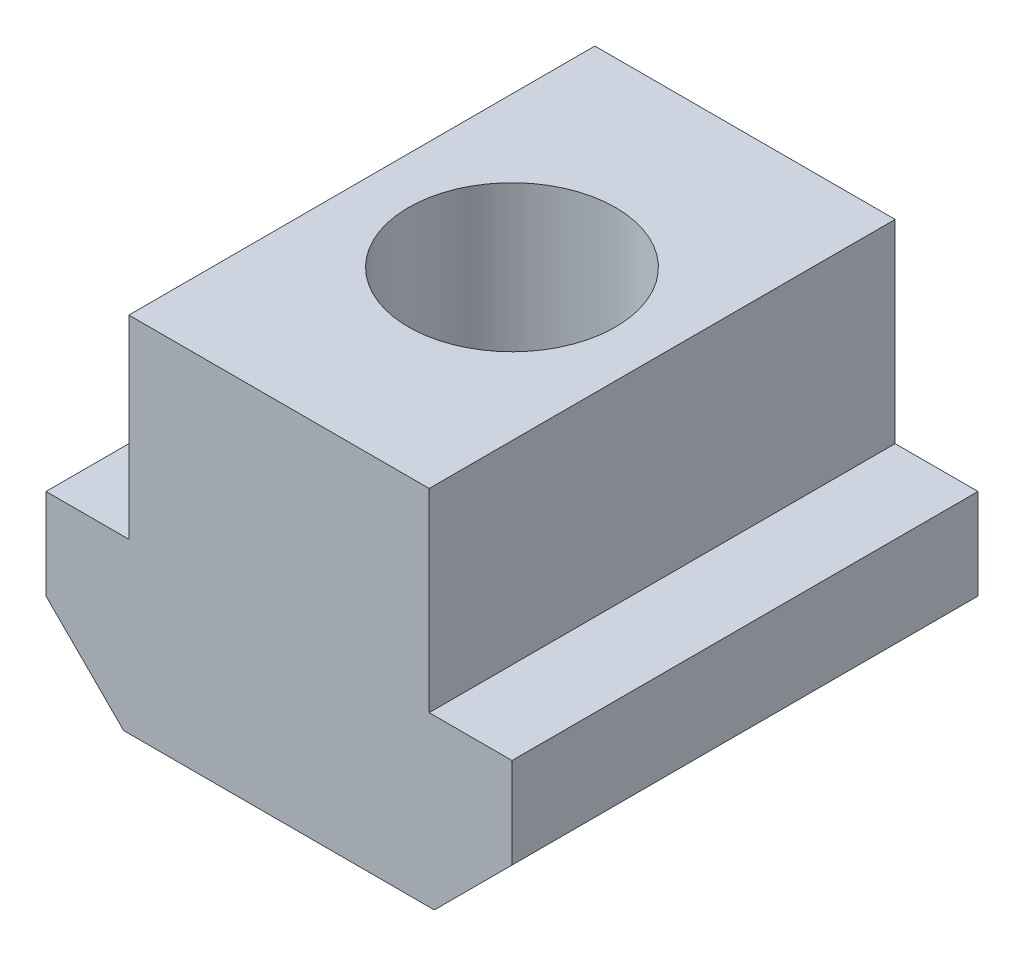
ISO-10303-21;
HEADER;
FILE_DESCRIPTION(('STEP AP214'),'2;1');
FILE_NAME('part.step','',(''),(''),'','','');
FILE_SCHEMA(('AUTOMOTIVE_DESIGN { 1 0 10303 214 1 1 1 1 }'));
ENDSEC;
DATA;
#1=APPLICATION_CONTEXT('core data for automotive mechanical design processes');
#2=APPLICATION_PROTOCOL_DEFINITION('international standard','automotive_design',2000,#1);
#3=PRODUCT_CONTEXT('',#1,'mechanical');
#4=PRODUCT('Part','Part','',(#3));
#5=PRODUCT_RELATED_PRODUCT_CATEGORY('part','',(#4));
#6=PRODUCT_DEFINITION_FORMATION('','',#4);
#7=PRODUCT_DEFINITION_CONTEXT('part definition',#1,'design');
#8=PRODUCT_DEFINITION('design','',#6,#7);
#9=PRODUCT_DEFINITION_SHAPE('','',#8);
#10=(LENGTH_UNIT() NAMED_UNIT(*) SI_UNIT(.MILLI.,.METRE.));
#11=(NAMED_UNIT(*) PLANE_ANGLE_UNIT() SI_UNIT($,.RADIAN.));
#12=(NAMED_UNIT(*) SI_UNIT($,.STERADIAN.) SOLID_ANGLE_UNIT());
#13=UNCERTAINTY_MEASURE_WITH_UNIT(LENGTH_MEASURE(1.E-05),#10,'distance_accuracy_value','');
#14=(GEOMETRIC_REPRESENTATION_CONTEXT(3) GLOBAL_UNCERTAINTY_ASSIGNED_CONTEXT((#13)) GLOBAL_UNIT_ASSIGNED_CONTEXT((#10,
#11,#12)) REPRESENTATION_CONTEXT('',''));
#15=CARTESIAN_POINT('',(0.,0.,0.));
#16=DIRECTION('',(0.,0.,1.));
#17=DIRECTION('',(1.,0.,0.));
#18=AXIS2_PLACEMENT_3D('',#15,#16,#17);
#19=CARTESIAN_POINT('',(-9.,7.,18.));
#20=DIRECTION('',(0.,-1.,0.));
#21=DIRECTION('',(0.,0.,-1.));
#22=AXIS2_PLACEMENT_3D('',#19,#20,#21);
#23=PLANE('',#22);
#24=CARTESIAN_POINT('',(0.,7.,9.));
#25=DIRECTION('',(0.,-1.,0.));
#26=DIRECTION('',(0.,0.,-1.));
#27=AXIS2_PLACEMENT_3D('',#24,#25,#26);
#28=CIRCLE('',#27,4.);
#29=CARTESIAN_POINT('',(0.,7.,5.));
#30=VERTEX_POINT('',#29);
#31=EDGE_CURVE('E195',#30,#30,#28,.T.);
#32=ORIENTED_EDGE('',*,*,#31,.T.);
#33=EDGE_LOOP('',(#32));
#34=FACE_BOUND('',#33,.T.);
#35=DIRECTION('',(0.,0.,-1.));
#36=VECTOR('',#35,1.);
#37=CARTESIAN_POINT('',(-5.8,7.,0.));
#38=LINE('',#37,#36);
#39=CARTESIAN_POINT('',(-5.8,7.,0.));
#40=VERTEX_POINT('',#39);
#41=CARTESIAN_POINT('',(-5.8,7.,18.));
#42=VERTEX_POINT('',#41);
#43=EDGE_CURVE('E164',#40,#42,#38,.F.);
#44=ORIENTED_EDGE('',*,*,#43,.T.);
#45=DIRECTION('',(-1.,0.,0.));
#46=VECTOR('',#45,1.);
#47=CARTESIAN_POINT('',(-9.,7.,18.));
#48=LINE('',#47,#46);
#49=CARTESIAN_POINT('',(5.8,7.,18.));
#50=VERTEX_POINT('',#49);
#51=EDGE_CURVE('E130',#50,#42,#48,.T.);
#52=ORIENTED_EDGE('',*,*,#51,.F.);
#53=DIRECTION('',(0.,0.,1.));
#54=VECTOR('',#53,1.);
#55=CARTESIAN_POINT('',(5.8,7.,0.));
#56=LINE('',#55,#54);
#57=CARTESIAN_POINT('',(5.8,7.,0.));
#58=VERTEX_POINT('',#57);
#59=EDGE_CURVE('E108',#50,#58,#56,.F.);
#60=ORIENTED_EDGE('',*,*,#59,.T.);
#61=DIRECTION('',(-1.,0.,0.));
#62=VECTOR('',#61,1.);
#63=CARTESIAN_POINT('',(-9.,7.,0.));
#64=LINE('',#63,#62);
#65=EDGE_CURVE('E150',#40,#58,#64,.F.);
#66=ORIENTED_EDGE('',*,*,#65,.F.);
#67=EDGE_LOOP('',(#44,#52,#60,#66));
#68=FACE_BOUND('',#67,.T.);
#69=ADVANCED_FACE('F17',(#34,#68),#23,.F.);
#70=CARTESIAN_POINT('',(-9.,-7.,18.));
#71=DIRECTION('',(0.,1.,0.));
#72=DIRECTION('',(0.,0.,1.));
#73=AXIS2_PLACEMENT_3D('',#70,#71,#72);
#74=PLANE('',#73);
#75=CARTESIAN_POINT('',(0.,-7.,9.));
#76=DIRECTION('',(0.,-1.,0.));
#77=DIRECTION('',(0.,0.,-1.));
#78=AXIS2_PLACEMENT_3D('',#75,#76,#77);
#79=CIRCLE('',#78,4.);
#80=CARTESIAN_POINT('',(0.,-7.,5.));
#81=VERTEX_POINT('',#80);
#82=EDGE_CURVE('E198',#81,#81,#79,.T.);
#83=ORIENTED_EDGE('',*,*,#82,.F.);
#84=EDGE_LOOP('',(#83));
#85=FACE_BOUND('',#84,.T.);
#86=DIRECTION('',(0.,0.,1.));
#87=VECTOR('',#86,1.);
#88=CARTESIAN_POINT('',(6.,-7.,18.));
#89=LINE('',#88,#87);
#90=CARTESIAN_POINT('',(6.,-7.,0.));
#91=VERTEX_POINT('',#90);
#92=CARTESIAN_POINT('',(6.,-7.,18.));
#93=VERTEX_POINT('',#92);
#94=EDGE_CURVE('E186',#91,#93,#89,.T.);
#95=ORIENTED_EDGE('',*,*,#94,.T.);
#96=DIRECTION('',(1.,0.,0.));
#97=VECTOR('',#96,1.);
#98=CARTESIAN_POINT('',(-9.,-7.,18.));
#99=LINE('',#98,#97);
#100=CARTESIAN_POINT('',(-6.,-7.,18.));
#101=VERTEX_POINT('',#100);
#102=EDGE_CURVE('E11',#101,#93,#99,.T.);
#103=ORIENTED_EDGE('',*,*,#102,.F.);
#104=DIRECTION('',(0.,0.,1.));
#105=VECTOR('',#104,1.);
#106=CARTESIAN_POINT('',(-6.,-7.,18.));
#107=LINE('',#106,#105);
#108=CARTESIAN_POINT('',(-6.,-7.,0.));
#109=VERTEX_POINT('',#108);
#110=EDGE_CURVE('E101',#101,#109,#107,.F.);
#111=ORIENTED_EDGE('',*,*,#110,.T.);
#112=DIRECTION('',(-1.,0.,0.));
#113=VECTOR('',#112,1.);
#114=CARTESIAN_POINT('',(-9.,-7.,0.));
#115=LINE('',#114,#113);
#116=EDGE_CURVE('E133',#109,#91,#115,.F.);
#117=ORIENTED_EDGE('',*,*,#116,.T.);
#118=EDGE_LOOP('',(#95,#103,#111,#117));
#119=FACE_BOUND('',#118,.T.);
#120=ADVANCED_FACE('F207',(#85,#119),#74,.F.);
#121=CARTESIAN_POINT('',(-9.,-7.,0.));
#122=DIRECTION('',(0.,0.,1.));
#123=DIRECTION('',(1.,0.,0.));
#124=AXIS2_PLACEMENT_3D('',#121,#122,#123);
#125=PLANE('',#124);
#126=DIRECTION('',(0.,-1.,0.));
#127=VECTOR('',#126,1.);
#128=CARTESIAN_POINT('',(9.,-7.,0.));
#129=LINE('',#128,#127);
#130=CARTESIAN_POINT('',(9.,-4.,0.));
#131=VERTEX_POINT('',#130);
#132=CARTESIAN_POINT('',(9.,-0.500000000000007,0.));
#133=VERTEX_POINT('',#132);
#134=EDGE_CURVE('E139',#131,#133,#129,.F.);
#135=ORIENTED_EDGE('',*,*,#134,.F.);
#136=DIRECTION('',(-0.707106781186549,-0.707106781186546,0.));
#137=VECTOR('',#136,1.);
#138=CARTESIAN_POINT('',(9.,-4.,0.));
#139=LINE('',#138,#137);
#140=EDGE_CURVE('E96',#131,#91,#139,.T.);
#141=ORIENTED_EDGE('',*,*,#140,.T.);
#142=ORIENTED_EDGE('',*,*,#116,.F.);
#143=DIRECTION('',(-0.707106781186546,0.707106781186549,0.));
#144=VECTOR('',#143,1.);
#145=CARTESIAN_POINT('',(-6.,-7.,0.));
#146=LINE('',#145,#144);
#147=CARTESIAN_POINT('',(-9.,-4.,0.));
#148=VERTEX_POINT('',#147);
#149=EDGE_CURVE('E182',#109,#148,#146,.T.);
#150=ORIENTED_EDGE('',*,*,#149,.T.);
#151=DIRECTION('',(0.,-1.,0.));
#152=VECTOR('',#151,1.);
#153=CARTESIAN_POINT('',(-9.,7.,0.));
#154=LINE('',#153,#152);
#155=CARTESIAN_POINT('',(-9.,-0.5,0.));
#156=VERTEX_POINT('',#155);
#157=EDGE_CURVE('E136',#148,#156,#154,.F.);
#158=ORIENTED_EDGE('',*,*,#157,.T.);
#159=DIRECTION('',(-1.,0.,0.));
#160=VECTOR('',#159,1.);
#161=CARTESIAN_POINT('',(9.,-0.500000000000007,0.));
#162=LINE('',#161,#160);
#163=CARTESIAN_POINT('',(-5.8,-0.5,0.));
#164=VERTEX_POINT('',#163);
#165=EDGE_CURVE('E144',#156,#164,#162,.F.);
#166=ORIENTED_EDGE('',*,*,#165,.T.);
#167=DIRECTION('',(0.,-1.,0.));
#168=VECTOR('',#167,1.);
#169=CARTESIAN_POINT('',(-5.8,7.,0.));
#170=LINE('',#169,#168);
#171=EDGE_CURVE('E147',#164,#40,#170,.F.);
#172=ORIENTED_EDGE('',*,*,#171,.T.);
#173=ORIENTED_EDGE('',*,*,#65,.T.);
#174=DIRECTION('',(0.,-1.,0.));
#175=VECTOR('',#174,1.);
#176=CARTESIAN_POINT('',(5.8,-7.,0.));
#177=LINE('',#176,#175);
#178=CARTESIAN_POINT('',(5.8,-0.500000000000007,0.));
#179=VERTEX_POINT('',#178);
#180=EDGE_CURVE('E25',#179,#58,#177,.F.);
#181=ORIENTED_EDGE('',*,*,#180,.F.);
#182=DIRECTION('',(1.,0.,0.));
#183=VECTOR('',#182,1.);
#184=CARTESIAN_POINT('',(-9.,-0.5,0.));
#185=LINE('',#184,#183);
#186=EDGE_CURVE('E141',#133,#179,#185,.F.);
#187=ORIENTED_EDGE('',*,*,#186,.F.);
#188=EDGE_LOOP('',(#135,#141,#142,#150,#158,#166,#172,#173,#181,#187));
#189=FACE_BOUND('',#188,.T.);
#190=ADVANCED_FACE('F19',(#189),#125,.F.);
#191=CARTESIAN_POINT('',(9.,7.,18.));
#192=DIRECTION('',(-1.,0.,0.));
#193=DIRECTION('',(0.,-1.,0.));
#194=AXIS2_PLACEMENT_3D('',#191,#192,#193);
#195=PLANE('',#194);
#196=DIRECTION('',(0.,0.,-1.));
#197=VECTOR('',#196,1.);
#198=CARTESIAN_POINT('',(9.,-0.500000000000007,0.));
#199=LINE('',#198,#197);
#200=CARTESIAN_POINT('',(9.,-0.5,18.));
#201=VERTEX_POINT('',#200);
#202=EDGE_CURVE('E111',#133,#201,#199,.F.);
#203=ORIENTED_EDGE('',*,*,#202,.T.);
#204=DIRECTION('',(0.,1.,0.));
#205=VECTOR('',#204,1.);
#206=CARTESIAN_POINT('',(9.,7.,18.));
#207=LINE('',#206,#205);
#208=CARTESIAN_POINT('',(9.,-4.,18.));
#209=VERTEX_POINT('',#208);
#210=EDGE_CURVE('E106',#209,#201,#207,.T.);
#211=ORIENTED_EDGE('',*,*,#210,.F.);
#212=DIRECTION('',(0.,0.,1.));
#213=VECTOR('',#212,1.);
#214=CARTESIAN_POINT('',(9.,-4.,18.));
#215=LINE('',#214,#213);
#216=EDGE_CURVE('E94',#209,#131,#215,.F.);
#217=ORIENTED_EDGE('',*,*,#216,.T.);
#218=ORIENTED_EDGE('',*,*,#134,.T.);
#219=EDGE_LOOP('',(#203,#211,#217,#218));
#220=FACE_BOUND('',#219,.T.);
#221=ADVANCED_FACE('F110',(#220),#195,.F.);
#222=CARTESIAN_POINT('',(9.,-0.500000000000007,0.));
#223=DIRECTION('',(0.,-1.,0.));
#224=DIRECTION('',(1.,0.,0.));
#225=AXIS2_PLACEMENT_3D('',#222,#223,#224);
#226=PLANE('',#225);
#227=DIRECTION('',(0.,0.,1.));
#228=VECTOR('',#227,1.);
#229=CARTESIAN_POINT('',(5.8,-0.500000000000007,0.));
#230=LINE('',#229,#228);
#231=CARTESIAN_POINT('',(5.8,-0.5,18.));
#232=VERTEX_POINT('',#231);
#233=EDGE_CURVE('E158',#179,#232,#230,.T.);
#234=ORIENTED_EDGE('',*,*,#233,.T.);
#235=DIRECTION('',(-1.,0.,0.));
#236=VECTOR('',#235,1.);
#237=CARTESIAN_POINT('',(-9.,-0.499999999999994,18.));
#238=LINE('',#237,#236);
#239=EDGE_CURVE('E117',#201,#232,#238,.T.);
#240=ORIENTED_EDGE('',*,*,#239,.F.);
#241=ORIENTED_EDGE('',*,*,#202,.F.);
#242=ORIENTED_EDGE('',*,*,#186,.T.);
#243=EDGE_LOOP('',(#234,#240,#241,#242));
#244=FACE_BOUND('',#243,.T.);
#245=ADVANCED_FACE('F211',(#244),#226,.F.);
#246=CARTESIAN_POINT('',(5.8,7.,0.));
#247=DIRECTION('',(-1.,0.,0.));
#248=DIRECTION('',(0.,-1.,0.));
#249=AXIS2_PLACEMENT_3D('',#246,#247,#248);
#250=PLANE('',#249);
#251=ORIENTED_EDGE('',*,*,#59,.F.);
#252=DIRECTION('',(0.,1.,0.));
#253=VECTOR('',#252,1.);
#254=CARTESIAN_POINT('',(5.8,7.,18.));
#255=LINE('',#254,#253);
#256=EDGE_CURVE('E124',#232,#50,#255,.T.);
#257=ORIENTED_EDGE('',*,*,#256,.F.);
#258=ORIENTED_EDGE('',*,*,#233,.F.);
#259=ORIENTED_EDGE('',*,*,#180,.T.);
#260=EDGE_LOOP('',(#251,#257,#258,#259));
#261=FACE_BOUND('',#260,.T.);
#262=ADVANCED_FACE('F155',(#261),#250,.F.);
#263=CARTESIAN_POINT('',(-5.8,7.,0.));
#264=DIRECTION('',(1.,0.,0.));
#265=DIRECTION('',(0.,1.,0.));
#266=AXIS2_PLACEMENT_3D('',#263,#264,#265);
#267=PLANE('',#266);
#268=DIRECTION('',(0.,0.,-1.));
#269=VECTOR('',#268,1.);
#270=CARTESIAN_POINT('',(-5.8,-0.5,0.));
#271=LINE('',#270,#269);
#272=CARTESIAN_POINT('',(-5.8,-0.499999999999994,18.));
#273=VERTEX_POINT('',#272);
#274=EDGE_CURVE('E193',#164,#273,#271,.F.);
#275=ORIENTED_EDGE('',*,*,#274,.T.);
#276=DIRECTION('',(0.,1.,0.));
#277=VECTOR('',#276,1.);
#278=CARTESIAN_POINT('',(-5.8,-7.,18.));
#279=LINE('',#278,#277);
#280=EDGE_CURVE('E127',#273,#42,#279,.T.);
#281=ORIENTED_EDGE('',*,*,#280,.T.);
#282=ORIENTED_EDGE('',*,*,#43,.F.);
#283=ORIENTED_EDGE('',*,*,#171,.F.);
#284=EDGE_LOOP('',(#275,#281,#282,#283));
#285=FACE_BOUND('',#284,.T.);
#286=ADVANCED_FACE('F212',(#285),#267,.F.);
#287=CARTESIAN_POINT('',(-9.,-0.5,0.));
#288=DIRECTION('',(0.,-1.,0.));
#289=DIRECTION('',(0.,0.,-1.));
#290=AXIS2_PLACEMENT_3D('',#287,#288,#289);
#291=PLANE('',#290);
#292=DIRECTION('',(0.,0.,-1.));
#293=VECTOR('',#292,1.);
#294=CARTESIAN_POINT('',(-9.,-0.499999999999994,18.));
#295=LINE('',#294,#293);
#296=CARTESIAN_POINT('',(-9.,-0.499999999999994,18.));
#297=VERTEX_POINT('',#296);
#298=EDGE_CURVE('E166',#156,#297,#295,.F.);
#299=ORIENTED_EDGE('',*,*,#298,.T.);
#300=DIRECTION('',(1.,0.,0.));
#301=VECTOR('',#300,1.);
#302=CARTESIAN_POINT('',(-9.,-0.499999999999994,18.));
#303=LINE('',#302,#301);
#304=EDGE_CURVE('E113',#297,#273,#303,.T.);
#305=ORIENTED_EDGE('',*,*,#304,.T.);
#306=ORIENTED_EDGE('',*,*,#274,.F.);
#307=ORIENTED_EDGE('',*,*,#165,.F.);
#308=EDGE_LOOP('',(#299,#305,#306,#307));
#309=FACE_BOUND('',#308,.T.);
#310=ADVANCED_FACE('F174',(#309),#291,.F.);
#311=CARTESIAN_POINT('',(-9.,7.,18.));
#312=DIRECTION('',(1.,0.,0.));
#313=DIRECTION('',(0.,0.,-1.));
#314=AXIS2_PLACEMENT_3D('',#311,#312,#313);
#315=PLANE('',#314);
#316=DIRECTION('',(0.,0.,1.));
#317=VECTOR('',#316,1.);
#318=CARTESIAN_POINT('',(-9.,-4.,18.));
#319=LINE('',#318,#317);
#320=CARTESIAN_POINT('',(-9.,-4.,18.));
#321=VERTEX_POINT('',#320);
#322=EDGE_CURVE('E180',#148,#321,#319,.T.);
#323=ORIENTED_EDGE('',*,*,#322,.T.);
#324=DIRECTION('',(0.,1.,0.));
#325=VECTOR('',#324,1.);
#326=CARTESIAN_POINT('',(-9.,-7.,18.));
#327=LINE('',#326,#325);
#328=EDGE_CURVE('E114',#321,#297,#327,.T.);
#329=ORIENTED_EDGE('',*,*,#328,.T.);
#330=ORIENTED_EDGE('',*,*,#298,.F.);
#331=ORIENTED_EDGE('',*,*,#157,.F.);
#332=EDGE_LOOP('',(#323,#329,#330,#331));
#333=FACE_BOUND('',#332,.T.);
#334=ADVANCED_FACE('F178',(#333),#315,.F.);
#335=CARTESIAN_POINT('',(-6.,-7.,18.));
#336=DIRECTION('',(0.707106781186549,0.707106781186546,0.));
#337=DIRECTION('',(-0.707106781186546,0.707106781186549,0.));
#338=AXIS2_PLACEMENT_3D('',#335,#336,#337);
#339=PLANE('',#338);
#340=ORIENTED_EDGE('',*,*,#110,.F.);
#341=DIRECTION('',(0.707106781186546,-0.707106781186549,0.));
#342=VECTOR('',#341,1.);
#343=CARTESIAN_POINT('',(-8.5,-4.5,18.));
#344=LINE('',#343,#342);
#345=EDGE_CURVE('E39',#321,#101,#344,.T.);
#346=ORIENTED_EDGE('',*,*,#345,.F.);
#347=ORIENTED_EDGE('',*,*,#322,.F.);
#348=ORIENTED_EDGE('',*,*,#149,.F.);
#349=EDGE_LOOP('',(#340,#346,#347,#348));
#350=FACE_BOUND('',#349,.T.);
#351=ADVANCED_FACE('F184',(#350),#339,.F.);
#352=CARTESIAN_POINT('',(9.,-4.,18.));
#353=DIRECTION('',(-0.707106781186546,0.707106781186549,0.));
#354=DIRECTION('',(-0.707106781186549,-0.707106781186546,0.));
#355=AXIS2_PLACEMENT_3D('',#352,#353,#354);
#356=PLANE('',#355);
#357=DIRECTION('',(0.70710678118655,0.707106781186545,0.));
#358=VECTOR('',#357,1.);
#359=CARTESIAN_POINT('',(6.5,-6.5,18.));
#360=LINE('',#359,#358);
#361=EDGE_CURVE('E32',#93,#209,#360,.T.);
#362=ORIENTED_EDGE('',*,*,#361,.F.);
#363=ORIENTED_EDGE('',*,*,#94,.F.);
#364=ORIENTED_EDGE('',*,*,#140,.F.);
#365=ORIENTED_EDGE('',*,*,#216,.F.);
#366=EDGE_LOOP('',(#362,#363,#364,#365));
#367=FACE_BOUND('',#366,.T.);
#368=ADVANCED_FACE('F95',(#367),#356,.F.);
#369=CARTESIAN_POINT('',(-9.,-7.,18.));
#370=DIRECTION('',(0.,0.,1.));
#371=DIRECTION('',(1.,0.,0.));
#372=AXIS2_PLACEMENT_3D('',#369,#370,#371);
#373=PLANE('',#372);
#374=ORIENTED_EDGE('',*,*,#328,.F.);
#375=ORIENTED_EDGE('',*,*,#345,.T.);
#376=ORIENTED_EDGE('',*,*,#102,.T.);
#377=ORIENTED_EDGE('',*,*,#361,.T.);
#378=ORIENTED_EDGE('',*,*,#210,.T.);
#379=ORIENTED_EDGE('',*,*,#239,.T.);
#380=ORIENTED_EDGE('',*,*,#256,.T.);
#381=ORIENTED_EDGE('',*,*,#51,.T.);
#382=ORIENTED_EDGE('',*,*,#280,.F.);
#383=ORIENTED_EDGE('',*,*,#304,.F.);
#384=EDGE_LOOP('',(#374,#375,#376,#377,#378,#379,#380,#381,#382,#383));
#385=FACE_BOUND('',#384,.T.);
#386=ADVANCED_FACE('F104',(#385),#373,.T.);
#387=CARTESIAN_POINT('',(0.,7.,9.));
#388=DIRECTION('',(0.,-1.,0.));
#389=DIRECTION('',(0.,0.,-1.));
#390=AXIS2_PLACEMENT_3D('',#387,#388,#389);
#391=CYLINDRICAL_SURFACE('',#390,4.);
#392=ORIENTED_EDGE('',*,*,#31,.F.);
#393=EDGE_LOOP('',(#392));
#394=FACE_BOUND('',#393,.T.);
#395=ORIENTED_EDGE('',*,*,#82,.T.);
#396=EDGE_LOOP('',(#395));
#397=FACE_BOUND('',#396,.T.);
#398=ADVANCED_FACE('F205',(#394,#397),#391,.F.);
#399=CLOSED_SHELL('',(#69,#120,#190,#221,#245,#262,#286,#310,#334,#351,#368,#386,#398));
#400=MANIFOLD_SOLID_BREP('B1',#399);
#401=ADVANCED_BREP_SHAPE_REPRESENTATION('',(#18,#400),#14);
#402=SHAPE_DEFINITION_REPRESENTATION(#9,#401);
ENDSEC;
END-ISO-10303-21;
